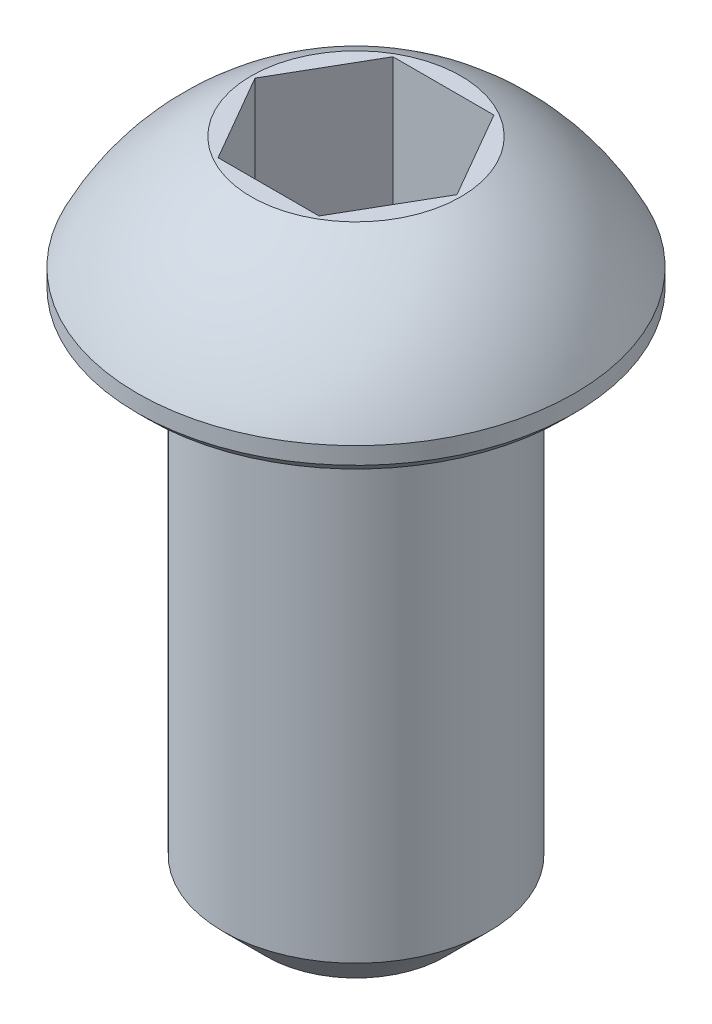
ISO-10303-21;
HEADER;
FILE_DESCRIPTION(('STEP AP214'),'2;1');
FILE_NAME('part.step','',(''),(''),'','','');
FILE_SCHEMA(('AUTOMOTIVE_DESIGN { 1 0 10303 214 1 1 1 1 }'));
ENDSEC;
DATA;
#1=APPLICATION_CONTEXT('core data for automotive mechanical design processes');
#2=APPLICATION_PROTOCOL_DEFINITION('international standard','automotive_design',2000,#1);
#3=PRODUCT_CONTEXT('',#1,'mechanical');
#4=PRODUCT('Part','Part','',(#3));
#5=PRODUCT_RELATED_PRODUCT_CATEGORY('part','',(#4));
#6=PRODUCT_DEFINITION_FORMATION('','',#4);
#7=PRODUCT_DEFINITION_CONTEXT('part definition',#1,'design');
#8=PRODUCT_DEFINITION('design','',#6,#7);
#9=PRODUCT_DEFINITION_SHAPE('','',#8);
#10=(LENGTH_UNIT() NAMED_UNIT(*) SI_UNIT(.MILLI.,.METRE.));
#11=(NAMED_UNIT(*) PLANE_ANGLE_UNIT() SI_UNIT($,.RADIAN.));
#12=(NAMED_UNIT(*) SI_UNIT($,.STERADIAN.) SOLID_ANGLE_UNIT());
#13=UNCERTAINTY_MEASURE_WITH_UNIT(LENGTH_MEASURE(1.E-05),#10,'distance_accuracy_value','');
#14=(GEOMETRIC_REPRESENTATION_CONTEXT(3) GLOBAL_UNCERTAINTY_ASSIGNED_CONTEXT((#13)) GLOBAL_UNIT_ASSIGNED_CONTEXT((#10,
#11,#12)) REPRESENTATION_CONTEXT('',''));
#15=CARTESIAN_POINT('',(0.,0.,0.));
#16=DIRECTION('',(0.,0.,1.));
#17=DIRECTION('',(1.,0.,0.));
#18=AXIS2_PLACEMENT_3D('',#15,#16,#17);
#19=CARTESIAN_POINT('',(0.,-1.41126320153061,0.));
#20=DIRECTION('',(0.,1.,0.));
#21=DIRECTION('',(1.,0.,0.));
#22=AXIS2_PLACEMENT_3D('',#19,#20,#21);
#23=SPHERICAL_SURFACE('',#22,4.40846320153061);
#24=CARTESIAN_POINT('',(0.,2.5654,0.));
#25=DIRECTION('',(0.,1.,0.));
#26=DIRECTION('',(0.,0.,1.));
#27=AXIS2_PLACEMENT_3D('',#24,#25,#26);
#28=CIRCLE('',#27,1.90281307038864);
#29=CARTESIAN_POINT('',(1.90281307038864,2.5654,0.));
#30=VERTEX_POINT('',#29);
#31=EDGE_CURVE('E145',#30,#30,#28,.T.);
#32=CARTESIAN_POINT('',(0.,0.508,0.));
#33=DIRECTION('',(0.,1.,0.));
#34=DIRECTION('',(0.,0.,1.));
#35=AXIS2_PLACEMENT_3D('',#32,#33,#34);
#36=CIRCLE('',#35,3.96875);
#37=CARTESIAN_POINT('',(3.96875,0.508,0.));
#38=VERTEX_POINT('',#37);
#39=EDGE_CURVE('E134',#38,#38,#36,.T.);
#40=CARTESIAN_POINT('',(1.90281307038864,2.5654,0.));
#41=CARTESIAN_POINT('',(1.93073521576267,2.55203945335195,0.));
#42=CARTESIAN_POINT('',(1.95851659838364,2.53838473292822,0.));
#43=CARTESIAN_POINT('',(2.01378561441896,2.51049320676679,0.));
#44=CARTESIAN_POINT('',(2.04127324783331,2.49625640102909,0.));
#45=CARTESIAN_POINT('',(2.09594254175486,2.4672069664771,0.));
#46=CARTESIAN_POINT('',(2.12312420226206,2.45239433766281,0.));
#47=CARTESIAN_POINT('',(2.17716949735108,2.42219984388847,0.));
#48=CARTESIAN_POINT('',(2.2040331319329,2.40681797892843,0.));
#49=CARTESIAN_POINT('',(2.25743045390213,2.37549183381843,0.));
#50=CARTESIAN_POINT('',(2.28396414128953,2.35954755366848,0.));
#51=CARTESIAN_POINT('',(2.33668979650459,2.32710365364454,0.));
#52=CARTESIAN_POINT('',(2.36288176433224,2.31060403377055,0.));
#53=CARTESIAN_POINT('',(2.41491235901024,2.27705677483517,0.));
#54=CARTESIAN_POINT('',(2.4407509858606,2.26000913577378,0.));
#55=CARTESIAN_POINT('',(2.49206343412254,2.22537340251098,0.));
#56=CARTESIAN_POINT('',(2.51753725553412,2.20778530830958,0.));
#57=CARTESIAN_POINT('',(2.56810879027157,2.17207646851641,0.));
#58=CARTESIAN_POINT('',(2.59320650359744,2.15395572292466,0.));
#59=CARTESIAN_POINT('',(2.64301468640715,2.11718962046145,0.));
#60=CARTESIAN_POINT('',(2.66772515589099,2.09854426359,0.));
#61=CARTESIAN_POINT('',(2.71674788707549,2.0607372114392,0.));
#62=CARTESIAN_POINT('',(2.74106014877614,2.04157551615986,0.));
#63=CARTESIAN_POINT('',(2.78927567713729,2.00274428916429,0.));
#64=CARTESIAN_POINT('',(2.81317894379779,1.98307475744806,0.));
#65=CARTESIAN_POINT('',(2.86056587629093,1.94323658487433,0.));
#66=CARTESIAN_POINT('',(2.88404954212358,1.92306794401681,0.));
#67=CARTESIAN_POINT('',(2.93058685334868,1.88224050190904,0.));
#68=CARTESIAN_POINT('',(2.95364049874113,1.86158170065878,0.));
#69=CARTESIAN_POINT('',(2.99930754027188,1.81978310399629,0.));
#70=CARTESIAN_POINT('',(3.02192093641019,1.79864330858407,0.));
#71=CARTESIAN_POINT('',(3.06669744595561,1.75589210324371,0.));
#72=CARTESIAN_POINT('',(3.08886055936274,1.73428069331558,0.));
#73=CARTESIAN_POINT('',(3.13272666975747,1.69059584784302,0.));
#74=CARTESIAN_POINT('',(3.15442966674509,1.66852241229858,0.));
#75=CARTESIAN_POINT('',(3.19736591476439,1.62392330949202,0.));
#76=CARTESIAN_POINT('',(3.21859916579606,1.60139764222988,0.));
#77=CARTESIAN_POINT('',(3.26058650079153,1.55590407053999,0.));
#78=CARTESIAN_POINT('',(3.28134058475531,1.53293616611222,0.));
#79=CARTESIAN_POINT('',(3.32236037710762,1.48656831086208,0.));
#80=CARTESIAN_POINT('',(3.34262608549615,1.4631683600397,0.));
#81=CARTESIAN_POINT('',(3.38266013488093,1.41594679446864,0.));
#82=CARTESIAN_POINT('',(3.40242847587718,1.39212517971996,0.));
#83=CARTESIAN_POINT('',(3.4414590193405,1.34407085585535,0.));
#84=CARTESIAN_POINT('',(3.46072122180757,1.31983814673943,0.));
#85=CARTESIAN_POINT('',(3.49873094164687,1.27097238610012,0.));
#86=CARTESIAN_POINT('',(3.5174784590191,1.24633933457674,0.));
#87=CARTESIAN_POINT('',(3.5544504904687,1.19668381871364,0.));
#88=CARTESIAN_POINT('',(3.57267500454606,1.17166135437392,0.));
#89=CARTESIAN_POINT('',(3.6085929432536,1.12123811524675,0.));
#90=CARTESIAN_POINT('',(3.62628636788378,1.09583734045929,0.));
#91=CARTESIAN_POINT('',(3.66113427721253,1.04466875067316,0.));
#92=CARTESIAN_POINT('',(3.6782887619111,1.01890093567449,0.));
#93=CARTESIAN_POINT('',(3.71205117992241,0.967009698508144,0.));
#94=CARTESIAN_POINT('',(3.72865911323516,0.940886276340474,0.));
#95=CARTESIAN_POINT('',(3.76132105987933,0.888295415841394,0.));
#96=CARTESIAN_POINT('',(3.77737507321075,0.861827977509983,0.));
#97=CARTESIAN_POINT('',(3.80892205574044,0.808560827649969,0.));
#98=CARTESIAN_POINT('',(3.82441502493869,0.781761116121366,0.));
#99=CARTESIAN_POINT('',(3.85483304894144,0.727841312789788,0.));
#100=CARTESIAN_POINT('',(3.86975810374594,0.700721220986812,0.));
#101=CARTESIAN_POINT('',(3.89903366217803,0.646172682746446,0.));
#102=CARTESIAN_POINT('',(3.91338416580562,0.618744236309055,0.));
#103=CARTESIAN_POINT('',(3.9415043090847,0.563591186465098,0.));
#104=CARTESIAN_POINT('',(3.95527394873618,0.535866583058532,0.));
#105=CARTESIAN_POINT('',(3.96875,0.508,0.));
#106=B_SPLINE_CURVE_WITH_KNOTS('',3,(#40,#41,#42,#43,#44,#45,#46,#47,#48,#49,#50,#51,#52,#53,
#54,#55,#56,#57,#58,#59,#60,#61,#62,#63,#64,#65,#66,#67,#68,#69,#70,#71,#72,#73,#74,#75,#76,#77,
#78,#79,#80,#81,#82,#83,#84,#85,#86,#87,#88,#89,#90,#91,#92,#93,#94,#95,#96,#97,#98,#99,#100,
#101,#102,#103,#104,#105),.UNSPECIFIED.,.F.,.F.,(4,2,2,2,2,2,2,2,2,2,2,2,2,2,2,2,2,2,2,2,2,2,2,
2,2,2,2,2,2,2,2,2,4),(0.,0.0928602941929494,0.1857205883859,0.27858088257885,0.371441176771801,
0.46430147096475,0.557161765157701,0.650022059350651,0.742882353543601,0.835742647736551,
0.928602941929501,1.02146323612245,1.1143235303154,1.20718382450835,1.3000441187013,
1.39290441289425,1.4857647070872,1.57862500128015,1.6714852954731,1.76434558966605,
1.857205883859,1.95006617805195,2.0429264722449,2.13578676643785,2.2286470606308,
2.32150735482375,2.4143676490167,2.50722794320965,2.6000882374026,2.69294853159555,
2.7858088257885,2.87866911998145,2.9715294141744),.UNSPECIFIED.);
#107=EDGE_CURVE('BSEAM32',#30,#38,#106,.T.);
#108=ORIENTED_EDGE('',*,*,#31,.F.);
#109=ORIENTED_EDGE('',*,*,#39,.T.);
#110=ORIENTED_EDGE('',*,*,#107,.T.);
#111=ORIENTED_EDGE('',*,*,#107,.F.);
#112=EDGE_LOOP('',(#108,#110,#109,#111));
#113=FACE_BOUND('',#112,.T.);
#114=ADVANCED_FACE('F32',(#113),#23,.T.);
#115=CARTESIAN_POINT('',(1.90281307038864,2.5654,0.));
#116=DIRECTION('',(0.,-1.,0.));
#117=DIRECTION('',(0.,0.,-1.));
#118=AXIS2_PLACEMENT_3D('',#115,#116,#117);
#119=PLANE('',#118);
#120=DIRECTION('',(0.499999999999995,0.,0.866025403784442));
#121=VECTOR('',#120,1.);
#122=CARTESIAN_POINT('',(-1.83308710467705,2.5654,0.));
#123=LINE('',#122,#121);
#124=CARTESIAN_POINT('',(-1.83308710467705,2.5654,0.));
#125=VERTEX_POINT('',#124);
#126=CARTESIAN_POINT('',(-0.916543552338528,2.5654,1.5875));
#127=VERTEX_POINT('',#126);
#128=EDGE_CURVE('E121',#125,#127,#123,.T.);
#129=ORIENTED_EDGE('',*,*,#128,.F.);
#130=DIRECTION('',(-0.499999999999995,0.,0.866025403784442));
#131=VECTOR('',#130,1.);
#132=CARTESIAN_POINT('',(-0.916543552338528,2.5654,-1.5875));
#133=LINE('',#132,#131);
#134=CARTESIAN_POINT('',(-0.916543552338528,2.5654,-1.5875));
#135=VERTEX_POINT('',#134);
#136=EDGE_CURVE('E47',#135,#125,#133,.T.);
#137=ORIENTED_EDGE('',*,*,#136,.F.);
#138=DIRECTION('',(-1.,0.,0.));
#139=VECTOR('',#138,1.);
#140=CARTESIAN_POINT('',(-0.916543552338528,2.5654,-1.5875));
#141=LINE('',#140,#139);
#142=CARTESIAN_POINT('',(0.916543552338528,2.5654,-1.5875));
#143=VERTEX_POINT('',#142);
#144=EDGE_CURVE('E130',#143,#135,#141,.T.);
#145=ORIENTED_EDGE('',*,*,#144,.F.);
#146=DIRECTION('',(-0.499999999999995,0.,-0.866025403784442));
#147=VECTOR('',#146,1.);
#148=CARTESIAN_POINT('',(0.916543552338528,2.5654,-1.5875));
#149=LINE('',#148,#147);
#150=CARTESIAN_POINT('',(1.83308710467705,2.5654,0.));
#151=VERTEX_POINT('',#150);
#152=EDGE_CURVE('E128',#151,#143,#149,.T.);
#153=ORIENTED_EDGE('',*,*,#152,.F.);
#154=DIRECTION('',(0.499999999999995,0.,-0.866025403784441));
#155=VECTOR('',#154,1.);
#156=CARTESIAN_POINT('',(0.916543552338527,2.5654,1.5875));
#157=LINE('',#156,#155);
#158=CARTESIAN_POINT('',(0.916543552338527,2.5654,1.5875));
#159=VERTEX_POINT('',#158);
#160=EDGE_CURVE('E95',#159,#151,#157,.T.);
#161=ORIENTED_EDGE('',*,*,#160,.F.);
#162=DIRECTION('',(1.,0.,0.));
#163=VECTOR('',#162,1.);
#164=CARTESIAN_POINT('',(-0.916543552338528,2.5654,1.5875));
#165=LINE('',#164,#163);
#166=EDGE_CURVE('E124',#127,#159,#165,.T.);
#167=ORIENTED_EDGE('',*,*,#166,.F.);
#168=EDGE_LOOP('',(#129,#137,#145,#153,#161,#167));
#169=FACE_BOUND('',#168,.T.);
#170=ORIENTED_EDGE('',*,*,#31,.T.);
#171=EDGE_LOOP('',(#170));
#172=FACE_BOUND('',#171,.T.);
#173=ADVANCED_FACE('F168',(#169,#172),#119,.F.);
#174=CARTESIAN_POINT('',(2.413,-9.525,0.));
#175=DIRECTION('',(0.,1.,0.));
#176=DIRECTION('',(0.,0.,1.));
#177=AXIS2_PLACEMENT_3D('',#174,#175,#176);
#178=PLANE('',#177);
#179=CARTESIAN_POINT('',(0.,-9.525,0.));
#180=DIRECTION('',(0.,1.,0.));
#181=DIRECTION('',(0.,0.,1.));
#182=AXIS2_PLACEMENT_3D('',#179,#180,#181);
#183=CIRCLE('',#182,1.61925);
#184=CARTESIAN_POINT('',(0.,-9.525,1.61925));
#185=VERTEX_POINT('',#184);
#186=EDGE_CURVE('E11',#185,#185,#183,.F.);
#187=ORIENTED_EDGE('',*,*,#186,.T.);
#188=EDGE_LOOP('',(#187));
#189=FACE_BOUND('',#188,.T.);
#190=ADVANCED_FACE('F174',(#189),#178,.F.);
#191=CARTESIAN_POINT('',(0.,0.,0.));
#192=DIRECTION('',(0.,1.,0.));
#193=DIRECTION('',(0.,0.,1.));
#194=AXIS2_PLACEMENT_3D('',#191,#192,#193);
#195=CYLINDRICAL_SURFACE('',#194,2.413);
#196=CARTESIAN_POINT('',(0.,-8.73125,0.));
#197=DIRECTION('',(0.,1.,0.));
#198=DIRECTION('',(0.,0.,1.));
#199=AXIS2_PLACEMENT_3D('',#196,#197,#198);
#200=CIRCLE('',#199,2.413);
#201=CARTESIAN_POINT('',(0.,-8.73125,2.413));
#202=VERTEX_POINT('',#201);
#203=EDGE_CURVE('E40',#202,#202,#200,.T.);
#204=ORIENTED_EDGE('',*,*,#203,.T.);
#205=EDGE_LOOP('',(#204));
#206=FACE_BOUND('',#205,.T.);
#207=CARTESIAN_POINT('',(0.,0.,0.));
#208=DIRECTION('',(0.,1.,0.));
#209=DIRECTION('',(0.,0.,1.));
#210=AXIS2_PLACEMENT_3D('',#207,#208,#209);
#211=CIRCLE('',#210,2.413);
#212=CARTESIAN_POINT('',(0.,0.,2.413));
#213=VERTEX_POINT('',#212);
#214=EDGE_CURVE('E142',#213,#213,#211,.T.);
#215=ORIENTED_EDGE('',*,*,#214,.F.);
#216=EDGE_LOOP('',(#215));
#217=FACE_BOUND('',#216,.T.);
#218=ADVANCED_FACE('F156',(#206,#217),#195,.T.);
#219=CARTESIAN_POINT('',(3.96875,0.,0.));
#220=DIRECTION('',(0.,1.,0.));
#221=DIRECTION('',(0.,0.,1.));
#222=AXIS2_PLACEMENT_3D('',#219,#220,#221);
#223=PLANE('',#222);
#224=CARTESIAN_POINT('',(0.,0.,0.));
#225=DIRECTION('',(0.,1.,0.));
#226=DIRECTION('',(0.,0.,1.));
#227=AXIS2_PLACEMENT_3D('',#224,#225,#226);
#228=CIRCLE('',#227,3.77031249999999);
#229=CARTESIAN_POINT('',(0.,0.,3.77031249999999));
#230=VERTEX_POINT('',#229);
#231=EDGE_CURVE('E151',#230,#230,#228,.F.);
#232=ORIENTED_EDGE('',*,*,#231,.T.);
#233=EDGE_LOOP('',(#232));
#234=FACE_BOUND('',#233,.T.);
#235=ORIENTED_EDGE('',*,*,#214,.T.);
#236=EDGE_LOOP('',(#235));
#237=FACE_BOUND('',#236,.T.);
#238=ADVANCED_FACE('F185',(#234,#237),#223,.F.);
#239=CARTESIAN_POINT('',(0.,0.,0.));
#240=DIRECTION('',(0.,1.,0.));
#241=DIRECTION('',(0.,0.,1.));
#242=AXIS2_PLACEMENT_3D('',#239,#240,#241);
#243=CYLINDRICAL_SURFACE('',#242,3.96875);
#244=CARTESIAN_POINT('',(0.,0.198437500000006,0.));
#245=DIRECTION('',(0.,1.,0.));
#246=DIRECTION('',(0.,0.,1.));
#247=AXIS2_PLACEMENT_3D('',#244,#245,#246);
#248=CIRCLE('',#247,3.96875);
#249=CARTESIAN_POINT('',(0.,0.198437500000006,3.96875));
#250=VERTEX_POINT('',#249);
#251=EDGE_CURVE('E148',#250,#250,#248,.T.);
#252=ORIENTED_EDGE('',*,*,#251,.T.);
#253=EDGE_LOOP('',(#252));
#254=FACE_BOUND('',#253,.T.);
#255=ORIENTED_EDGE('',*,*,#39,.F.);
#256=EDGE_LOOP('',(#255));
#257=FACE_BOUND('',#256,.T.);
#258=ADVANCED_FACE('F188',(#254,#257),#243,.T.);
#259=CARTESIAN_POINT('',(-0.916543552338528,0.18415,-1.5875));
#260=DIRECTION('',(-0.866025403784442,0.,-0.499999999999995));
#261=DIRECTION('',(-0.499999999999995,0.,0.866025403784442));
#262=AXIS2_PLACEMENT_3D('',#259,#260,#261);
#263=PLANE('',#262);
#264=ORIENTED_EDGE('',*,*,#136,.T.);
#265=DIRECTION('',(0.,1.,0.));
#266=VECTOR('',#265,1.);
#267=CARTESIAN_POINT('',(-1.83308710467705,0.18415,0.));
#268=LINE('',#267,#266);
#269=CARTESIAN_POINT('',(-1.83308710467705,0.18415,0.));
#270=VERTEX_POINT('',#269);
#271=EDGE_CURVE('E77',#270,#125,#268,.T.);
#272=ORIENTED_EDGE('',*,*,#271,.F.);
#273=DIRECTION('',(-0.499999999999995,0.,0.866025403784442));
#274=VECTOR('',#273,1.);
#275=CARTESIAN_POINT('',(-0.916543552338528,0.18415,-1.5875));
#276=LINE('',#275,#274);
#277=CARTESIAN_POINT('',(-0.916543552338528,0.18415,-1.5875));
#278=VERTEX_POINT('',#277);
#279=EDGE_CURVE('E132',#278,#270,#276,.T.);
#280=ORIENTED_EDGE('',*,*,#279,.F.);
#281=DIRECTION('',(0.,1.,0.));
#282=VECTOR('',#281,1.);
#283=CARTESIAN_POINT('',(-0.916543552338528,0.18415,-1.5875));
#284=LINE('',#283,#282);
#285=EDGE_CURVE('E55',#278,#135,#284,.T.);
#286=ORIENTED_EDGE('',*,*,#285,.T.);
#287=EDGE_LOOP('',(#264,#272,#280,#286));
#288=FACE_BOUND('',#287,.T.);
#289=ADVANCED_FACE('F192',(#288),#263,.F.);
#290=CARTESIAN_POINT('',(-0.916543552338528,0.18415,-1.5875));
#291=DIRECTION('',(0.,0.,-1.));
#292=DIRECTION('',(-1.,0.,0.));
#293=AXIS2_PLACEMENT_3D('',#290,#291,#292);
#294=PLANE('',#293);
#295=ORIENTED_EDGE('',*,*,#144,.T.);
#296=ORIENTED_EDGE('',*,*,#285,.F.);
#297=DIRECTION('',(-1.,0.,0.));
#298=VECTOR('',#297,1.);
#299=CARTESIAN_POINT('',(-0.916543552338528,0.18415,-1.5875));
#300=LINE('',#299,#298);
#301=CARTESIAN_POINT('',(0.916543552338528,0.18415,-1.5875));
#302=VERTEX_POINT('',#301);
#303=EDGE_CURVE('E107',#302,#278,#300,.T.);
#304=ORIENTED_EDGE('',*,*,#303,.F.);
#305=DIRECTION('',(0.,1.,0.));
#306=VECTOR('',#305,1.);
#307=CARTESIAN_POINT('',(0.916543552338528,0.18415,-1.5875));
#308=LINE('',#307,#306);
#309=EDGE_CURVE('E99',#302,#143,#308,.T.);
#310=ORIENTED_EDGE('',*,*,#309,.T.);
#311=EDGE_LOOP('',(#295,#296,#304,#310));
#312=FACE_BOUND('',#311,.T.);
#313=ADVANCED_FACE('F196',(#312),#294,.F.);
#314=CARTESIAN_POINT('',(0.916543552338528,0.18415,-1.5875));
#315=DIRECTION('',(0.866025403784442,0.,-0.499999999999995));
#316=DIRECTION('',(-0.499999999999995,0.,-0.866025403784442));
#317=AXIS2_PLACEMENT_3D('',#314,#315,#316);
#318=PLANE('',#317);
#319=ORIENTED_EDGE('',*,*,#152,.T.);
#320=ORIENTED_EDGE('',*,*,#309,.F.);
#321=DIRECTION('',(-0.499999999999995,0.,-0.866025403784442));
#322=VECTOR('',#321,1.);
#323=CARTESIAN_POINT('',(0.916543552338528,0.18415,-1.5875));
#324=LINE('',#323,#322);
#325=CARTESIAN_POINT('',(1.83308710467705,0.18415,0.));
#326=VERTEX_POINT('',#325);
#327=EDGE_CURVE('E103',#326,#302,#324,.T.);
#328=ORIENTED_EDGE('',*,*,#327,.F.);
#329=DIRECTION('',(0.,1.,0.));
#330=VECTOR('',#329,1.);
#331=CARTESIAN_POINT('',(1.83308710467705,0.18415,0.));
#332=LINE('',#331,#330);
#333=EDGE_CURVE('E88',#326,#151,#332,.T.);
#334=ORIENTED_EDGE('',*,*,#333,.T.);
#335=EDGE_LOOP('',(#319,#320,#328,#334));
#336=FACE_BOUND('',#335,.T.);
#337=ADVANCED_FACE('F104',(#336),#318,.F.);
#338=CARTESIAN_POINT('',(0.916543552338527,0.18415,1.5875));
#339=DIRECTION('',(0.866025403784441,0.,0.499999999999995));
#340=DIRECTION('',(0.499999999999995,0.,-0.866025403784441));
#341=AXIS2_PLACEMENT_3D('',#338,#339,#340);
#342=PLANE('',#341);
#343=ORIENTED_EDGE('',*,*,#160,.T.);
#344=ORIENTED_EDGE('',*,*,#333,.F.);
#345=DIRECTION('',(0.499999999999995,0.,-0.866025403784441));
#346=VECTOR('',#345,1.);
#347=CARTESIAN_POINT('',(0.916543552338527,0.18415,1.5875));
#348=LINE('',#347,#346);
#349=CARTESIAN_POINT('',(0.916543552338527,0.18415,1.5875));
#350=VERTEX_POINT('',#349);
#351=EDGE_CURVE('E92',#350,#326,#348,.T.);
#352=ORIENTED_EDGE('',*,*,#351,.F.);
#353=DIRECTION('',(0.,1.,0.));
#354=VECTOR('',#353,1.);
#355=CARTESIAN_POINT('',(0.916543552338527,0.18415,1.5875));
#356=LINE('',#355,#354);
#357=EDGE_CURVE('E100',#350,#159,#356,.T.);
#358=ORIENTED_EDGE('',*,*,#357,.T.);
#359=EDGE_LOOP('',(#343,#344,#352,#358));
#360=FACE_BOUND('',#359,.T.);
#361=ADVANCED_FACE('F90',(#360),#342,.F.);
#362=CARTESIAN_POINT('',(-0.916543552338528,0.18415,1.5875));
#363=DIRECTION('',(0.,0.,1.));
#364=DIRECTION('',(1.,0.,0.));
#365=AXIS2_PLACEMENT_3D('',#362,#363,#364);
#366=PLANE('',#365);
#367=ORIENTED_EDGE('',*,*,#166,.T.);
#368=ORIENTED_EDGE('',*,*,#357,.F.);
#369=DIRECTION('',(1.,0.,0.));
#370=VECTOR('',#369,1.);
#371=CARTESIAN_POINT('',(-0.916543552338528,0.18415,1.5875));
#372=LINE('',#371,#370);
#373=CARTESIAN_POINT('',(-0.916543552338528,0.18415,1.5875));
#374=VERTEX_POINT('',#373);
#375=EDGE_CURVE('E113',#374,#350,#372,.T.);
#376=ORIENTED_EDGE('',*,*,#375,.F.);
#377=DIRECTION('',(0.,1.,0.));
#378=VECTOR('',#377,1.);
#379=CARTESIAN_POINT('',(-0.916543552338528,0.18415,1.5875));
#380=LINE('',#379,#378);
#381=EDGE_CURVE('E137',#374,#127,#380,.T.);
#382=ORIENTED_EDGE('',*,*,#381,.T.);
#383=EDGE_LOOP('',(#367,#368,#376,#382));
#384=FACE_BOUND('',#383,.T.);
#385=ADVANCED_FACE('F200',(#384),#366,.F.);
#386=CARTESIAN_POINT('',(-1.83308710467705,0.18415,0.));
#387=DIRECTION('',(-0.866025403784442,0.,0.499999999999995));
#388=DIRECTION('',(0.499999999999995,0.,0.866025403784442));
#389=AXIS2_PLACEMENT_3D('',#386,#387,#388);
#390=PLANE('',#389);
#391=ORIENTED_EDGE('',*,*,#128,.T.);
#392=ORIENTED_EDGE('',*,*,#381,.F.);
#393=DIRECTION('',(0.499999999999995,0.,0.866025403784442));
#394=VECTOR('',#393,1.);
#395=CARTESIAN_POINT('',(-1.83308710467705,0.18415,0.));
#396=LINE('',#395,#394);
#397=EDGE_CURVE('E115',#270,#374,#396,.T.);
#398=ORIENTED_EDGE('',*,*,#397,.F.);
#399=ORIENTED_EDGE('',*,*,#271,.T.);
#400=EDGE_LOOP('',(#391,#392,#398,#399));
#401=FACE_BOUND('',#400,.T.);
#402=ADVANCED_FACE('F197',(#401),#390,.F.);
#403=CARTESIAN_POINT('',(-1.83308710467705,0.18415,0.));
#404=DIRECTION('',(0.,1.,0.));
#405=DIRECTION('',(0.,0.,1.));
#406=AXIS2_PLACEMENT_3D('',#403,#404,#405);
#407=PLANE('',#406);
#408=ORIENTED_EDGE('',*,*,#279,.T.);
#409=ORIENTED_EDGE('',*,*,#397,.T.);
#410=ORIENTED_EDGE('',*,*,#375,.T.);
#411=ORIENTED_EDGE('',*,*,#351,.T.);
#412=ORIENTED_EDGE('',*,*,#327,.T.);
#413=ORIENTED_EDGE('',*,*,#303,.T.);
#414=EDGE_LOOP('',(#408,#409,#410,#411,#412,#413));
#415=FACE_BOUND('',#414,.T.);
#416=ADVANCED_FACE('F110',(#415),#407,.T.);
#417=CARTESIAN_POINT('',(0.,0.198437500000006,0.));
#418=DIRECTION('',(0.,1.,0.));
#419=DIRECTION('',(0.,0.,1.));
#420=AXIS2_PLACEMENT_3D('',#417,#418,#419);
#421=CONICAL_SURFACE('',#420,3.96875,0.785398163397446);
#422=ORIENTED_EDGE('',*,*,#231,.F.);
#423=EDGE_LOOP('',(#422));
#424=FACE_BOUND('',#423,.T.);
#425=ORIENTED_EDGE('',*,*,#251,.F.);
#426=EDGE_LOOP('',(#425));
#427=FACE_BOUND('',#426,.T.);
#428=ADVANCED_FACE('F160',(#424,#427),#421,.T.);
#429=CARTESIAN_POINT('',(0.,-8.73125,0.));
#430=DIRECTION('',(0.,1.,0.));
#431=DIRECTION('',(0.,0.,1.));
#432=AXIS2_PLACEMENT_3D('',#429,#430,#431);
#433=CONICAL_SURFACE('',#432,2.413,0.78539816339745);
#434=ORIENTED_EDGE('',*,*,#186,.F.);
#435=EDGE_LOOP('',(#434));
#436=FACE_BOUND('',#435,.T.);
#437=ORIENTED_EDGE('',*,*,#203,.F.);
#438=EDGE_LOOP('',(#437));
#439=FACE_BOUND('',#438,.T.);
#440=ADVANCED_FACE('F34',(#436,#439),#433,.T.);
#441=CLOSED_SHELL('',(#114,#173,#190,#218,#238,#258,#289,#313,#337,#361,#385,#402,#416,#428,#440));
#442=MANIFOLD_SOLID_BREP('B2',#441);
#443=ADVANCED_BREP_SHAPE_REPRESENTATION('',(#18,#442),#14);
#444=SHAPE_DEFINITION_REPRESENTATION(#9,#443);
ENDSEC;
END-ISO-10303-21;
